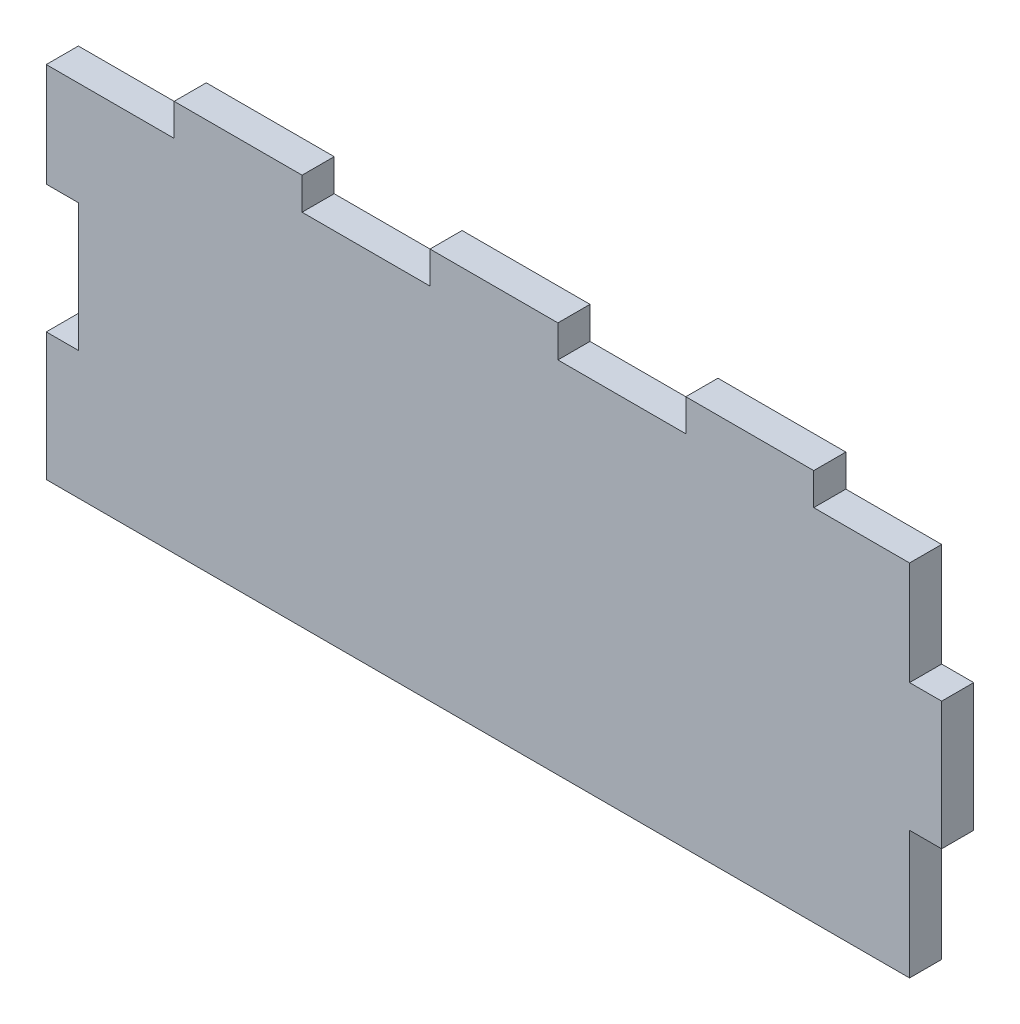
ISO-10303-21;
HEADER;
FILE_DESCRIPTION(('STEP AP214'),'2;1');
FILE_NAME('part.step','',(''),(''),'','','');
FILE_SCHEMA(('AUTOMOTIVE_DESIGN { 1 0 10303 214 1 1 1 1 }'));
ENDSEC;
DATA;
#1=APPLICATION_CONTEXT('core data for automotive mechanical design processes');
#2=APPLICATION_PROTOCOL_DEFINITION('international standard','automotive_design',2000,#1);
#3=PRODUCT_CONTEXT('',#1,'mechanical');
#4=PRODUCT('Part','Part','',(#3));
#5=PRODUCT_RELATED_PRODUCT_CATEGORY('part','',(#4));
#6=PRODUCT_DEFINITION_FORMATION('','',#4);
#7=PRODUCT_DEFINITION_CONTEXT('part definition',#1,'design');
#8=PRODUCT_DEFINITION('design','',#6,#7);
#9=PRODUCT_DEFINITION_SHAPE('','',#8);
#10=(LENGTH_UNIT() NAMED_UNIT(*) SI_UNIT(.MILLI.,.METRE.));
#11=(NAMED_UNIT(*) PLANE_ANGLE_UNIT() SI_UNIT($,.RADIAN.));
#12=(NAMED_UNIT(*) SI_UNIT($,.STERADIAN.) SOLID_ANGLE_UNIT());
#13=UNCERTAINTY_MEASURE_WITH_UNIT(LENGTH_MEASURE(1.E-05),#10,'distance_accuracy_value','');
#14=(GEOMETRIC_REPRESENTATION_CONTEXT(3) GLOBAL_UNCERTAINTY_ASSIGNED_CONTEXT((#13)) GLOBAL_UNIT_ASSIGNED_CONTEXT((#10,
#11,#12)) REPRESENTATION_CONTEXT('',''));
#15=CARTESIAN_POINT('',(0.,0.,0.));
#16=DIRECTION('',(0.,0.,1.));
#17=DIRECTION('',(1.,0.,0.));
#18=AXIS2_PLACEMENT_3D('',#15,#16,#17);
#19=CARTESIAN_POINT('',(417.168909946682,643.181563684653,19.));
#20=DIRECTION('',(0.,-1.,0.));
#21=DIRECTION('',(0.,0.,-1.));
#22=AXIS2_PLACEMENT_3D('',#19,#20,#21);
#23=PLANE('',#22);
#24=DIRECTION('',(-1.,0.,0.));
#25=VECTOR('',#24,1.);
#26=CARTESIAN_POINT('',(417.168909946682,643.181563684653,0.));
#27=LINE('',#26,#25);
#28=CARTESIAN_POINT('',(492.883195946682,643.181563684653,0.));
#29=VERTEX_POINT('',#28);
#30=CARTESIAN_POINT('',(417.168909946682,643.181563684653,0.));
#31=VERTEX_POINT('',#30);
#32=EDGE_CURVE('E225',#29,#31,#27,.T.);
#33=ORIENTED_EDGE('',*,*,#32,.T.);
#34=DIRECTION('',(0.,0.,-1.));
#35=VECTOR('',#34,1.);
#36=CARTESIAN_POINT('',(417.168909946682,643.181563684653,19.));
#37=LINE('',#36,#35);
#38=CARTESIAN_POINT('',(417.168909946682,643.181563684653,19.));
#39=VERTEX_POINT('',#38);
#40=EDGE_CURVE('E11',#39,#31,#37,.T.);
#41=ORIENTED_EDGE('',*,*,#40,.F.);
#42=DIRECTION('',(-1.,0.,0.));
#43=VECTOR('',#42,1.);
#44=CARTESIAN_POINT('',(417.168909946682,643.181563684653,19.));
#45=LINE('',#44,#43);
#46=CARTESIAN_POINT('',(492.883195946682,643.181563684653,19.));
#47=VERTEX_POINT('',#46);
#48=EDGE_CURVE('E271',#47,#39,#45,.T.);
#49=ORIENTED_EDGE('',*,*,#48,.F.);
#50=DIRECTION('',(0.,0.,-1.));
#51=VECTOR('',#50,1.);
#52=CARTESIAN_POINT('',(492.883195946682,643.181563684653,19.));
#53=LINE('',#52,#51);
#54=EDGE_CURVE('E221',#47,#29,#53,.T.);
#55=ORIENTED_EDGE('',*,*,#54,.T.);
#56=EDGE_LOOP('',(#33,#41,#49,#55));
#57=FACE_BOUND('',#56,.T.);
#58=ADVANCED_FACE('F33',(#57),#23,.F.);
#59=CARTESIAN_POINT('',(417.168909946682,643.181563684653,19.));
#60=DIRECTION('',(1.,0.,0.));
#61=DIRECTION('',(0.,1.,0.));
#62=AXIS2_PLACEMENT_3D('',#59,#60,#61);
#63=PLANE('',#62);
#64=DIRECTION('',(0.,-1.,0.));
#65=VECTOR('',#64,1.);
#66=CARTESIAN_POINT('',(417.168909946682,643.181563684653,0.));
#67=LINE('',#66,#65);
#68=CARTESIAN_POINT('',(417.168909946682,624.181563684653,0.));
#69=VERTEX_POINT('',#68);
#70=EDGE_CURVE('E228',#31,#69,#67,.T.);
#71=ORIENTED_EDGE('',*,*,#70,.T.);
#72=DIRECTION('',(0.,0.,-1.));
#73=VECTOR('',#72,1.);
#74=CARTESIAN_POINT('',(417.168909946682,624.181563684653,19.));
#75=LINE('',#74,#73);
#76=CARTESIAN_POINT('',(417.168909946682,624.181563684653,19.));
#77=VERTEX_POINT('',#76);
#78=EDGE_CURVE('E41',#77,#69,#75,.T.);
#79=ORIENTED_EDGE('',*,*,#78,.F.);
#80=DIRECTION('',(0.,-1.,0.));
#81=VECTOR('',#80,1.);
#82=CARTESIAN_POINT('',(417.168909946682,643.181563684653,19.));
#83=LINE('',#82,#81);
#84=EDGE_CURVE('E140',#39,#77,#83,.T.);
#85=ORIENTED_EDGE('',*,*,#84,.F.);
#86=ORIENTED_EDGE('',*,*,#40,.T.);
#87=EDGE_LOOP('',(#71,#79,#85,#86));
#88=FACE_BOUND('',#87,.T.);
#89=ADVANCED_FACE('F409',(#88),#63,.F.);
#90=CARTESIAN_POINT('',(341.454623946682,624.181563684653,19.));
#91=DIRECTION('',(0.,-1.,0.));
#92=DIRECTION('',(0.,0.,-1.));
#93=AXIS2_PLACEMENT_3D('',#90,#91,#92);
#94=PLANE('',#93);
#95=DIRECTION('',(-1.,0.,0.));
#96=VECTOR('',#95,1.);
#97=CARTESIAN_POINT('',(341.454623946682,624.181563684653,0.));
#98=LINE('',#97,#96);
#99=CARTESIAN_POINT('',(341.454623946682,624.181563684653,0.));
#100=VERTEX_POINT('',#99);
#101=EDGE_CURVE('E230',#69,#100,#98,.T.);
#102=ORIENTED_EDGE('',*,*,#101,.T.);
#103=DIRECTION('',(0.,0.,-1.));
#104=VECTOR('',#103,1.);
#105=CARTESIAN_POINT('',(341.454623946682,624.181563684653,19.));
#106=LINE('',#105,#104);
#107=CARTESIAN_POINT('',(341.454623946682,624.181563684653,19.));
#108=VERTEX_POINT('',#107);
#109=EDGE_CURVE('E326',#108,#100,#106,.T.);
#110=ORIENTED_EDGE('',*,*,#109,.F.);
#111=DIRECTION('',(-1.,0.,0.));
#112=VECTOR('',#111,1.);
#113=CARTESIAN_POINT('',(341.454623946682,624.181563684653,19.));
#114=LINE('',#113,#112);
#115=EDGE_CURVE('E334',#77,#108,#114,.T.);
#116=ORIENTED_EDGE('',*,*,#115,.F.);
#117=ORIENTED_EDGE('',*,*,#78,.T.);
#118=EDGE_LOOP('',(#102,#110,#116,#117));
#119=FACE_BOUND('',#118,.T.);
#120=ADVANCED_FACE('F332',(#119),#94,.F.);
#121=CARTESIAN_POINT('',(341.454623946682,562.852992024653,19.));
#122=DIRECTION('',(1.,0.,0.));
#123=DIRECTION('',(0.,0.,-1.));
#124=AXIS2_PLACEMENT_3D('',#121,#122,#123);
#125=PLANE('',#124);
#126=DIRECTION('',(0.,-1.,0.));
#127=VECTOR('',#126,1.);
#128=CARTESIAN_POINT('',(341.454623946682,562.852992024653,0.));
#129=LINE('',#128,#127);
#130=CARTESIAN_POINT('',(341.454623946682,562.852992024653,0.));
#131=VERTEX_POINT('',#130);
#132=EDGE_CURVE('E232',#100,#131,#129,.T.);
#133=ORIENTED_EDGE('',*,*,#132,.T.);
#134=DIRECTION('',(0.,0.,-1.));
#135=VECTOR('',#134,1.);
#136=CARTESIAN_POINT('',(341.454623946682,562.852992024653,19.));
#137=LINE('',#136,#135);
#138=CARTESIAN_POINT('',(341.454623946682,562.852992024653,19.));
#139=VERTEX_POINT('',#138);
#140=EDGE_CURVE('E323',#139,#131,#137,.T.);
#141=ORIENTED_EDGE('',*,*,#140,.F.);
#142=DIRECTION('',(0.,-1.,0.));
#143=VECTOR('',#142,1.);
#144=CARTESIAN_POINT('',(341.454623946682,562.852992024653,19.));
#145=LINE('',#144,#143);
#146=EDGE_CURVE('E352',#108,#139,#145,.T.);
#147=ORIENTED_EDGE('',*,*,#146,.F.);
#148=ORIENTED_EDGE('',*,*,#109,.T.);
#149=EDGE_LOOP('',(#133,#141,#147,#148));
#150=FACE_BOUND('',#149,.T.);
#151=ADVANCED_FACE('F343',(#150),#125,.F.);
#152=CARTESIAN_POINT('',(341.454623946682,562.852992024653,19.));
#153=DIRECTION('',(0.,1.,0.));
#154=DIRECTION('',(0.,0.,1.));
#155=AXIS2_PLACEMENT_3D('',#152,#153,#154);
#156=PLANE('',#155);
#157=DIRECTION('',(1.,0.,0.));
#158=VECTOR('',#157,1.);
#159=CARTESIAN_POINT('',(341.454623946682,562.852992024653,0.));
#160=LINE('',#159,#158);
#161=CARTESIAN_POINT('',(360.454623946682,562.852992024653,0.));
#162=VERTEX_POINT('',#161);
#163=EDGE_CURVE('E234',#131,#162,#160,.T.);
#164=ORIENTED_EDGE('',*,*,#163,.T.);
#165=DIRECTION('',(0.,0.,-1.));
#166=VECTOR('',#165,1.);
#167=CARTESIAN_POINT('',(360.454623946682,562.852992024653,19.));
#168=LINE('',#167,#166);
#169=CARTESIAN_POINT('',(360.454623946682,562.852992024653,19.));
#170=VERTEX_POINT('',#169);
#171=EDGE_CURVE('E320',#170,#162,#168,.T.);
#172=ORIENTED_EDGE('',*,*,#171,.F.);
#173=DIRECTION('',(1.,0.,0.));
#174=VECTOR('',#173,1.);
#175=CARTESIAN_POINT('',(341.454623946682,562.852992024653,19.));
#176=LINE('',#175,#174);
#177=EDGE_CURVE('E349',#139,#170,#176,.T.);
#178=ORIENTED_EDGE('',*,*,#177,.F.);
#179=ORIENTED_EDGE('',*,*,#140,.T.);
#180=EDGE_LOOP('',(#164,#172,#178,#179));
#181=FACE_BOUND('',#180,.T.);
#182=ADVANCED_FACE('F347',(#181),#156,.F.);
#183=CARTESIAN_POINT('',(360.454623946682,562.852992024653,19.));
#184=DIRECTION('',(1.,0.,0.));
#185=DIRECTION('',(0.,0.,-1.));
#186=AXIS2_PLACEMENT_3D('',#183,#184,#185);
#187=PLANE('',#186);
#188=DIRECTION('',(0.,-1.,0.));
#189=VECTOR('',#188,1.);
#190=CARTESIAN_POINT('',(360.454623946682,562.852992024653,0.));
#191=LINE('',#190,#189);
#192=CARTESIAN_POINT('',(360.454623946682,487.138706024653,0.));
#193=VERTEX_POINT('',#192);
#194=EDGE_CURVE('E236',#162,#193,#191,.T.);
#195=ORIENTED_EDGE('',*,*,#194,.T.);
#196=DIRECTION('',(0.,0.,-1.));
#197=VECTOR('',#196,1.);
#198=CARTESIAN_POINT('',(360.454623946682,487.138706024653,19.));
#199=LINE('',#198,#197);
#200=CARTESIAN_POINT('',(360.454623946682,487.138706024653,19.));
#201=VERTEX_POINT('',#200);
#202=EDGE_CURVE('E317',#201,#193,#199,.T.);
#203=ORIENTED_EDGE('',*,*,#202,.F.);
#204=DIRECTION('',(0.,-1.,0.));
#205=VECTOR('',#204,1.);
#206=CARTESIAN_POINT('',(360.454623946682,562.852992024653,19.));
#207=LINE('',#206,#205);
#208=EDGE_CURVE('E351',#170,#201,#207,.T.);
#209=ORIENTED_EDGE('',*,*,#208,.F.);
#210=ORIENTED_EDGE('',*,*,#171,.T.);
#211=EDGE_LOOP('',(#195,#203,#209,#210));
#212=FACE_BOUND('',#211,.T.);
#213=ADVANCED_FACE('F422',(#212),#187,.F.);
#214=CARTESIAN_POINT('',(341.454623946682,487.138706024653,19.));
#215=DIRECTION('',(0.,-1.,0.));
#216=DIRECTION('',(0.,0.,-1.));
#217=AXIS2_PLACEMENT_3D('',#214,#215,#216);
#218=PLANE('',#217);
#219=DIRECTION('',(-1.,0.,0.));
#220=VECTOR('',#219,1.);
#221=CARTESIAN_POINT('',(341.454623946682,487.138706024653,0.));
#222=LINE('',#221,#220);
#223=CARTESIAN_POINT('',(341.454623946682,487.138706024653,0.));
#224=VERTEX_POINT('',#223);
#225=EDGE_CURVE('E238',#193,#224,#222,.T.);
#226=ORIENTED_EDGE('',*,*,#225,.T.);
#227=DIRECTION('',(0.,0.,-1.));
#228=VECTOR('',#227,1.);
#229=CARTESIAN_POINT('',(341.454623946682,487.138706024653,19.));
#230=LINE('',#229,#228);
#231=CARTESIAN_POINT('',(341.454623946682,487.138706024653,19.));
#232=VERTEX_POINT('',#231);
#233=EDGE_CURVE('E314',#232,#224,#230,.T.);
#234=ORIENTED_EDGE('',*,*,#233,.F.);
#235=DIRECTION('',(-1.,0.,0.));
#236=VECTOR('',#235,1.);
#237=CARTESIAN_POINT('',(341.454623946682,487.138706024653,19.));
#238=LINE('',#237,#236);
#239=EDGE_CURVE('E354',#201,#232,#238,.T.);
#240=ORIENTED_EDGE('',*,*,#239,.F.);
#241=ORIENTED_EDGE('',*,*,#202,.T.);
#242=EDGE_LOOP('',(#226,#234,#240,#241));
#243=FACE_BOUND('',#242,.T.);
#244=ADVANCED_FACE('F425',(#243),#218,.F.);
#245=CARTESIAN_POINT('',(341.454623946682,487.138706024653,19.));
#246=DIRECTION('',(1.,0.,0.));
#247=DIRECTION('',(0.,0.,-1.));
#248=AXIS2_PLACEMENT_3D('',#245,#246,#247);
#249=PLANE('',#248);
#250=DIRECTION('',(0.,-1.,0.));
#251=VECTOR('',#250,1.);
#252=CARTESIAN_POINT('',(341.454623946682,487.138706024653,0.));
#253=LINE('',#252,#251);
#254=CARTESIAN_POINT('',(341.454623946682,411.424420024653,0.));
#255=VERTEX_POINT('',#254);
#256=EDGE_CURVE('E240',#224,#255,#253,.T.);
#257=ORIENTED_EDGE('',*,*,#256,.T.);
#258=DIRECTION('',(0.,0.,-1.));
#259=VECTOR('',#258,1.);
#260=CARTESIAN_POINT('',(341.454623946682,411.424420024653,19.));
#261=LINE('',#260,#259);
#262=CARTESIAN_POINT('',(341.454623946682,411.424420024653,19.));
#263=VERTEX_POINT('',#262);
#264=EDGE_CURVE('E311',#263,#255,#261,.T.);
#265=ORIENTED_EDGE('',*,*,#264,.F.);
#266=DIRECTION('',(0.,-1.,0.));
#267=VECTOR('',#266,1.);
#268=CARTESIAN_POINT('',(341.454623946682,487.138706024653,19.));
#269=LINE('',#268,#267);
#270=EDGE_CURVE('E360',#232,#263,#269,.T.);
#271=ORIENTED_EDGE('',*,*,#270,.F.);
#272=ORIENTED_EDGE('',*,*,#233,.T.);
#273=EDGE_LOOP('',(#257,#265,#271,#272));
#274=FACE_BOUND('',#273,.T.);
#275=ADVANCED_FACE('F429',(#274),#249,.F.);
#276=CARTESIAN_POINT('',(341.454623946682,411.424420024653,19.));
#277=DIRECTION('',(0.,1.,0.));
#278=DIRECTION('',(-1.,0.,0.));
#279=AXIS2_PLACEMENT_3D('',#276,#277,#278);
#280=PLANE('',#279);
#281=DIRECTION('',(1.,0.,0.));
#282=VECTOR('',#281,1.);
#283=CARTESIAN_POINT('',(341.454623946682,411.424420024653,0.));
#284=LINE('',#283,#282);
#285=CARTESIAN_POINT('',(852.454623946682,411.424420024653,0.));
#286=VERTEX_POINT('',#285);
#287=EDGE_CURVE('E242',#255,#286,#284,.T.);
#288=ORIENTED_EDGE('',*,*,#287,.T.);
#289=DIRECTION('',(0.,0.,-1.));
#290=VECTOR('',#289,1.);
#291=CARTESIAN_POINT('',(852.454623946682,411.424420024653,19.));
#292=LINE('',#291,#290);
#293=CARTESIAN_POINT('',(852.454623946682,411.424420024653,19.));
#294=VERTEX_POINT('',#293);
#295=EDGE_CURVE('E308',#294,#286,#292,.T.);
#296=ORIENTED_EDGE('',*,*,#295,.F.);
#297=DIRECTION('',(1.,0.,0.));
#298=VECTOR('',#297,1.);
#299=CARTESIAN_POINT('',(341.454623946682,411.424420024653,19.));
#300=LINE('',#299,#298);
#301=EDGE_CURVE('E362',#263,#294,#300,.T.);
#302=ORIENTED_EDGE('',*,*,#301,.F.);
#303=ORIENTED_EDGE('',*,*,#264,.T.);
#304=EDGE_LOOP('',(#288,#296,#302,#303));
#305=FACE_BOUND('',#304,.T.);
#306=ADVANCED_FACE('F433',(#305),#280,.F.);
#307=CARTESIAN_POINT('',(852.454623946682,487.138706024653,19.));
#308=DIRECTION('',(-1.,0.,0.));
#309=DIRECTION('',(0.,0.,1.));
#310=AXIS2_PLACEMENT_3D('',#307,#308,#309);
#311=PLANE('',#310);
#312=DIRECTION('',(0.,1.,0.));
#313=VECTOR('',#312,1.);
#314=CARTESIAN_POINT('',(852.454623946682,487.138706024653,0.));
#315=LINE('',#314,#313);
#316=CARTESIAN_POINT('',(852.454623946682,487.138706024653,0.));
#317=VERTEX_POINT('',#316);
#318=EDGE_CURVE('E244',#286,#317,#315,.T.);
#319=ORIENTED_EDGE('',*,*,#318,.T.);
#320=DIRECTION('',(0.,0.,-1.));
#321=VECTOR('',#320,1.);
#322=CARTESIAN_POINT('',(852.454623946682,487.138706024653,19.));
#323=LINE('',#322,#321);
#324=CARTESIAN_POINT('',(852.454623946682,487.138706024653,19.));
#325=VERTEX_POINT('',#324);
#326=EDGE_CURVE('E305',#325,#317,#323,.T.);
#327=ORIENTED_EDGE('',*,*,#326,.F.);
#328=DIRECTION('',(0.,1.,0.));
#329=VECTOR('',#328,1.);
#330=CARTESIAN_POINT('',(852.454623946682,487.138706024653,19.));
#331=LINE('',#330,#329);
#332=EDGE_CURVE('E364',#294,#325,#331,.T.);
#333=ORIENTED_EDGE('',*,*,#332,.F.);
#334=ORIENTED_EDGE('',*,*,#295,.T.);
#335=EDGE_LOOP('',(#319,#327,#333,#334));
#336=FACE_BOUND('',#335,.T.);
#337=ADVANCED_FACE('F437',(#336),#311,.F.);
#338=CARTESIAN_POINT('',(852.454623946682,487.138706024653,19.));
#339=DIRECTION('',(0.,1.,0.));
#340=DIRECTION('',(0.,0.,1.));
#341=AXIS2_PLACEMENT_3D('',#338,#339,#340);
#342=PLANE('',#341);
#343=DIRECTION('',(1.,0.,0.));
#344=VECTOR('',#343,1.);
#345=CARTESIAN_POINT('',(852.454623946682,487.138706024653,0.));
#346=LINE('',#345,#344);
#347=CARTESIAN_POINT('',(871.454623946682,487.138706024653,0.));
#348=VERTEX_POINT('',#347);
#349=EDGE_CURVE('E246',#317,#348,#346,.T.);
#350=ORIENTED_EDGE('',*,*,#349,.T.);
#351=DIRECTION('',(0.,0.,-1.));
#352=VECTOR('',#351,1.);
#353=CARTESIAN_POINT('',(871.454623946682,487.138706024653,19.));
#354=LINE('',#353,#352);
#355=CARTESIAN_POINT('',(871.454623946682,487.138706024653,19.));
#356=VERTEX_POINT('',#355);
#357=EDGE_CURVE('E302',#356,#348,#354,.T.);
#358=ORIENTED_EDGE('',*,*,#357,.F.);
#359=DIRECTION('',(1.,0.,0.));
#360=VECTOR('',#359,1.);
#361=CARTESIAN_POINT('',(852.454623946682,487.138706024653,19.));
#362=LINE('',#361,#360);
#363=EDGE_CURVE('E366',#325,#356,#362,.T.);
#364=ORIENTED_EDGE('',*,*,#363,.F.);
#365=ORIENTED_EDGE('',*,*,#326,.T.);
#366=EDGE_LOOP('',(#350,#358,#364,#365));
#367=FACE_BOUND('',#366,.T.);
#368=ADVANCED_FACE('F441',(#367),#342,.F.);
#369=CARTESIAN_POINT('',(871.454623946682,562.852992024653,19.));
#370=DIRECTION('',(-1.,0.,0.));
#371=DIRECTION('',(0.,0.,1.));
#372=AXIS2_PLACEMENT_3D('',#369,#370,#371);
#373=PLANE('',#372);
#374=DIRECTION('',(0.,1.,0.));
#375=VECTOR('',#374,1.);
#376=CARTESIAN_POINT('',(871.454623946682,562.852992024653,0.));
#377=LINE('',#376,#375);
#378=CARTESIAN_POINT('',(871.454623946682,562.852992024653,0.));
#379=VERTEX_POINT('',#378);
#380=EDGE_CURVE('E248',#348,#379,#377,.T.);
#381=ORIENTED_EDGE('',*,*,#380,.T.);
#382=DIRECTION('',(0.,0.,-1.));
#383=VECTOR('',#382,1.);
#384=CARTESIAN_POINT('',(871.454623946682,562.852992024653,19.));
#385=LINE('',#384,#383);
#386=CARTESIAN_POINT('',(871.454623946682,562.852992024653,19.));
#387=VERTEX_POINT('',#386);
#388=EDGE_CURVE('E299',#387,#379,#385,.T.);
#389=ORIENTED_EDGE('',*,*,#388,.F.);
#390=DIRECTION('',(0.,1.,0.));
#391=VECTOR('',#390,1.);
#392=CARTESIAN_POINT('',(871.454623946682,562.852992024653,19.));
#393=LINE('',#392,#391);
#394=EDGE_CURVE('E368',#356,#387,#393,.T.);
#395=ORIENTED_EDGE('',*,*,#394,.F.);
#396=ORIENTED_EDGE('',*,*,#357,.T.);
#397=EDGE_LOOP('',(#381,#389,#395,#396));
#398=FACE_BOUND('',#397,.T.);
#399=ADVANCED_FACE('F445',(#398),#373,.F.);
#400=CARTESIAN_POINT('',(852.454623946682,562.852992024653,19.));
#401=DIRECTION('',(0.,-1.,0.));
#402=DIRECTION('',(0.,0.,-1.));
#403=AXIS2_PLACEMENT_3D('',#400,#401,#402);
#404=PLANE('',#403);
#405=DIRECTION('',(-1.,0.,0.));
#406=VECTOR('',#405,1.);
#407=CARTESIAN_POINT('',(852.454623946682,562.852992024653,0.));
#408=LINE('',#407,#406);
#409=CARTESIAN_POINT('',(852.454623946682,562.852992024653,0.));
#410=VERTEX_POINT('',#409);
#411=EDGE_CURVE('E250',#379,#410,#408,.T.);
#412=ORIENTED_EDGE('',*,*,#411,.T.);
#413=DIRECTION('',(0.,0.,-1.));
#414=VECTOR('',#413,1.);
#415=CARTESIAN_POINT('',(852.454623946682,562.852992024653,19.));
#416=LINE('',#415,#414);
#417=CARTESIAN_POINT('',(852.454623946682,562.852992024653,19.));
#418=VERTEX_POINT('',#417);
#419=EDGE_CURVE('E296',#418,#410,#416,.T.);
#420=ORIENTED_EDGE('',*,*,#419,.F.);
#421=DIRECTION('',(-1.,0.,0.));
#422=VECTOR('',#421,1.);
#423=CARTESIAN_POINT('',(852.454623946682,562.852992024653,19.));
#424=LINE('',#423,#422);
#425=EDGE_CURVE('E370',#387,#418,#424,.T.);
#426=ORIENTED_EDGE('',*,*,#425,.F.);
#427=ORIENTED_EDGE('',*,*,#388,.T.);
#428=EDGE_LOOP('',(#412,#420,#426,#427));
#429=FACE_BOUND('',#428,.T.);
#430=ADVANCED_FACE('F449',(#429),#404,.F.);
#431=CARTESIAN_POINT('',(852.454623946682,624.181563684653,19.));
#432=DIRECTION('',(-1.,0.,0.));
#433=DIRECTION('',(0.,0.,1.));
#434=AXIS2_PLACEMENT_3D('',#431,#432,#433);
#435=PLANE('',#434);
#436=DIRECTION('',(0.,1.,0.));
#437=VECTOR('',#436,1.);
#438=CARTESIAN_POINT('',(852.454623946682,624.181563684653,0.));
#439=LINE('',#438,#437);
#440=CARTESIAN_POINT('',(852.454623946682,624.181563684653,0.));
#441=VERTEX_POINT('',#440);
#442=EDGE_CURVE('E252',#410,#441,#439,.T.);
#443=ORIENTED_EDGE('',*,*,#442,.T.);
#444=DIRECTION('',(0.,0.,-1.));
#445=VECTOR('',#444,1.);
#446=CARTESIAN_POINT('',(852.454623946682,624.181563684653,19.));
#447=LINE('',#446,#445);
#448=CARTESIAN_POINT('',(852.454623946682,624.181563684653,19.));
#449=VERTEX_POINT('',#448);
#450=EDGE_CURVE('E293',#449,#441,#447,.T.);
#451=ORIENTED_EDGE('',*,*,#450,.F.);
#452=DIRECTION('',(0.,1.,0.));
#453=VECTOR('',#452,1.);
#454=CARTESIAN_POINT('',(852.454623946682,624.181563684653,19.));
#455=LINE('',#454,#453);
#456=EDGE_CURVE('E372',#418,#449,#455,.T.);
#457=ORIENTED_EDGE('',*,*,#456,.F.);
#458=ORIENTED_EDGE('',*,*,#419,.T.);
#459=EDGE_LOOP('',(#443,#451,#457,#458));
#460=FACE_BOUND('',#459,.T.);
#461=ADVANCED_FACE('F453',(#460),#435,.F.);
#462=CARTESIAN_POINT('',(795.740339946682,624.181563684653,19.));
#463=DIRECTION('',(0.,-1.,0.));
#464=DIRECTION('',(0.,0.,-1.));
#465=AXIS2_PLACEMENT_3D('',#462,#463,#464);
#466=PLANE('',#465);
#467=DIRECTION('',(-1.,0.,0.));
#468=VECTOR('',#467,1.);
#469=CARTESIAN_POINT('',(795.740339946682,624.181563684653,0.));
#470=LINE('',#469,#468);
#471=CARTESIAN_POINT('',(795.740339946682,624.181563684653,0.));
#472=VERTEX_POINT('',#471);
#473=EDGE_CURVE('E254',#441,#472,#470,.T.);
#474=ORIENTED_EDGE('',*,*,#473,.T.);
#475=DIRECTION('',(0.,0.,-1.));
#476=VECTOR('',#475,1.);
#477=CARTESIAN_POINT('',(795.740339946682,624.181563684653,19.));
#478=LINE('',#477,#476);
#479=CARTESIAN_POINT('',(795.740339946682,624.181563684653,19.));
#480=VERTEX_POINT('',#479);
#481=EDGE_CURVE('E290',#480,#472,#478,.T.);
#482=ORIENTED_EDGE('',*,*,#481,.F.);
#483=DIRECTION('',(-1.,0.,0.));
#484=VECTOR('',#483,1.);
#485=CARTESIAN_POINT('',(795.740339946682,624.181563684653,19.));
#486=LINE('',#485,#484);
#487=EDGE_CURVE('E374',#449,#480,#486,.T.);
#488=ORIENTED_EDGE('',*,*,#487,.F.);
#489=ORIENTED_EDGE('',*,*,#450,.T.);
#490=EDGE_LOOP('',(#474,#482,#488,#489));
#491=FACE_BOUND('',#490,.T.);
#492=ADVANCED_FACE('F457',(#491),#466,.F.);
#493=CARTESIAN_POINT('',(795.740339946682,643.181563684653,19.));
#494=DIRECTION('',(-1.,0.,0.));
#495=DIRECTION('',(0.,0.,1.));
#496=AXIS2_PLACEMENT_3D('',#493,#494,#495);
#497=PLANE('',#496);
#498=DIRECTION('',(0.,1.,0.));
#499=VECTOR('',#498,1.);
#500=CARTESIAN_POINT('',(795.740339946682,643.181563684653,0.));
#501=LINE('',#500,#499);
#502=CARTESIAN_POINT('',(795.740339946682,643.181563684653,0.));
#503=VERTEX_POINT('',#502);
#504=EDGE_CURVE('E256',#472,#503,#501,.T.);
#505=ORIENTED_EDGE('',*,*,#504,.T.);
#506=DIRECTION('',(0.,0.,-1.));
#507=VECTOR('',#506,1.);
#508=CARTESIAN_POINT('',(795.740339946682,643.181563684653,19.));
#509=LINE('',#508,#507);
#510=CARTESIAN_POINT('',(795.740339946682,643.181563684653,19.));
#511=VERTEX_POINT('',#510);
#512=EDGE_CURVE('E287',#511,#503,#509,.T.);
#513=ORIENTED_EDGE('',*,*,#512,.F.);
#514=DIRECTION('',(0.,1.,0.));
#515=VECTOR('',#514,1.);
#516=CARTESIAN_POINT('',(795.740339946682,643.181563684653,19.));
#517=LINE('',#516,#515);
#518=EDGE_CURVE('E376',#480,#511,#517,.T.);
#519=ORIENTED_EDGE('',*,*,#518,.F.);
#520=ORIENTED_EDGE('',*,*,#481,.T.);
#521=EDGE_LOOP('',(#505,#513,#519,#520));
#522=FACE_BOUND('',#521,.T.);
#523=ADVANCED_FACE('F461',(#522),#497,.F.);
#524=CARTESIAN_POINT('',(720.026053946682,643.181563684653,19.));
#525=DIRECTION('',(0.,-1.,0.));
#526=DIRECTION('',(0.,0.,-1.));
#527=AXIS2_PLACEMENT_3D('',#524,#525,#526);
#528=PLANE('',#527);
#529=DIRECTION('',(-1.,0.,0.));
#530=VECTOR('',#529,1.);
#531=CARTESIAN_POINT('',(720.026053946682,643.181563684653,0.));
#532=LINE('',#531,#530);
#533=CARTESIAN_POINT('',(720.026053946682,643.181563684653,0.));
#534=VERTEX_POINT('',#533);
#535=EDGE_CURVE('E258',#503,#534,#532,.T.);
#536=ORIENTED_EDGE('',*,*,#535,.T.);
#537=DIRECTION('',(0.,0.,-1.));
#538=VECTOR('',#537,1.);
#539=CARTESIAN_POINT('',(720.026053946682,643.181563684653,19.));
#540=LINE('',#539,#538);
#541=CARTESIAN_POINT('',(720.026053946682,643.181563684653,19.));
#542=VERTEX_POINT('',#541);
#543=EDGE_CURVE('E284',#542,#534,#540,.T.);
#544=ORIENTED_EDGE('',*,*,#543,.F.);
#545=DIRECTION('',(-1.,0.,0.));
#546=VECTOR('',#545,1.);
#547=CARTESIAN_POINT('',(720.026053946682,643.181563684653,19.));
#548=LINE('',#547,#546);
#549=EDGE_CURVE('E378',#511,#542,#548,.T.);
#550=ORIENTED_EDGE('',*,*,#549,.F.);
#551=ORIENTED_EDGE('',*,*,#512,.T.);
#552=EDGE_LOOP('',(#536,#544,#550,#551));
#553=FACE_BOUND('',#552,.T.);
#554=ADVANCED_FACE('F465',(#553),#528,.F.);
#555=CARTESIAN_POINT('',(720.026053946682,643.181563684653,19.));
#556=DIRECTION('',(1.,0.,0.));
#557=DIRECTION('',(0.,0.,-1.));
#558=AXIS2_PLACEMENT_3D('',#555,#556,#557);
#559=PLANE('',#558);
#560=DIRECTION('',(0.,-1.,0.));
#561=VECTOR('',#560,1.);
#562=CARTESIAN_POINT('',(720.026053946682,643.181563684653,0.));
#563=LINE('',#562,#561);
#564=CARTESIAN_POINT('',(720.026053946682,624.181563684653,0.));
#565=VERTEX_POINT('',#564);
#566=EDGE_CURVE('E260',#534,#565,#563,.T.);
#567=ORIENTED_EDGE('',*,*,#566,.T.);
#568=DIRECTION('',(0.,0.,-1.));
#569=VECTOR('',#568,1.);
#570=CARTESIAN_POINT('',(720.026053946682,624.181563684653,19.));
#571=LINE('',#570,#569);
#572=CARTESIAN_POINT('',(720.026053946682,624.181563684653,19.));
#573=VERTEX_POINT('',#572);
#574=EDGE_CURVE('E281',#573,#565,#571,.T.);
#575=ORIENTED_EDGE('',*,*,#574,.F.);
#576=DIRECTION('',(0.,-1.,0.));
#577=VECTOR('',#576,1.);
#578=CARTESIAN_POINT('',(720.026053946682,643.181563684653,19.));
#579=LINE('',#578,#577);
#580=EDGE_CURVE('E380',#542,#573,#579,.T.);
#581=ORIENTED_EDGE('',*,*,#580,.F.);
#582=ORIENTED_EDGE('',*,*,#543,.T.);
#583=EDGE_LOOP('',(#567,#575,#581,#582));
#584=FACE_BOUND('',#583,.T.);
#585=ADVANCED_FACE('F469',(#584),#559,.F.);
#586=CARTESIAN_POINT('',(644.311767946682,624.181563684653,19.));
#587=DIRECTION('',(0.,-1.,0.));
#588=DIRECTION('',(0.,0.,-1.));
#589=AXIS2_PLACEMENT_3D('',#586,#587,#588);
#590=PLANE('',#589);
#591=DIRECTION('',(-1.,0.,0.));
#592=VECTOR('',#591,1.);
#593=CARTESIAN_POINT('',(644.311767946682,624.181563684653,0.));
#594=LINE('',#593,#592);
#595=CARTESIAN_POINT('',(644.311767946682,624.181563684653,0.));
#596=VERTEX_POINT('',#595);
#597=EDGE_CURVE('E262',#565,#596,#594,.T.);
#598=ORIENTED_EDGE('',*,*,#597,.T.);
#599=DIRECTION('',(0.,0.,-1.));
#600=VECTOR('',#599,1.);
#601=CARTESIAN_POINT('',(644.311767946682,624.181563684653,19.));
#602=LINE('',#601,#600);
#603=CARTESIAN_POINT('',(644.311767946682,624.181563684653,19.));
#604=VERTEX_POINT('',#603);
#605=EDGE_CURVE('E278',#604,#596,#602,.T.);
#606=ORIENTED_EDGE('',*,*,#605,.F.);
#607=DIRECTION('',(-1.,0.,0.));
#608=VECTOR('',#607,1.);
#609=CARTESIAN_POINT('',(644.311767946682,624.181563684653,19.));
#610=LINE('',#609,#608);
#611=EDGE_CURVE('E382',#573,#604,#610,.T.);
#612=ORIENTED_EDGE('',*,*,#611,.F.);
#613=ORIENTED_EDGE('',*,*,#574,.T.);
#614=EDGE_LOOP('',(#598,#606,#612,#613));
#615=FACE_BOUND('',#614,.T.);
#616=ADVANCED_FACE('F473',(#615),#590,.F.);
#617=CARTESIAN_POINT('',(644.311767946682,643.181563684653,19.));
#618=DIRECTION('',(-1.,0.,0.));
#619=DIRECTION('',(0.,0.,1.));
#620=AXIS2_PLACEMENT_3D('',#617,#618,#619);
#621=PLANE('',#620);
#622=DIRECTION('',(0.,1.,0.));
#623=VECTOR('',#622,1.);
#624=CARTESIAN_POINT('',(644.311767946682,643.181563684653,0.));
#625=LINE('',#624,#623);
#626=CARTESIAN_POINT('',(644.311767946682,643.181563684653,0.));
#627=VERTEX_POINT('',#626);
#628=EDGE_CURVE('E264',#596,#627,#625,.T.);
#629=ORIENTED_EDGE('',*,*,#628,.T.);
#630=DIRECTION('',(0.,0.,-1.));
#631=VECTOR('',#630,1.);
#632=CARTESIAN_POINT('',(644.311767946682,643.181563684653,19.));
#633=LINE('',#632,#631);
#634=CARTESIAN_POINT('',(644.311767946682,643.181563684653,19.));
#635=VERTEX_POINT('',#634);
#636=EDGE_CURVE('E275',#635,#627,#633,.T.);
#637=ORIENTED_EDGE('',*,*,#636,.F.);
#638=DIRECTION('',(0.,1.,0.));
#639=VECTOR('',#638,1.);
#640=CARTESIAN_POINT('',(644.311767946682,643.181563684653,19.));
#641=LINE('',#640,#639);
#642=EDGE_CURVE('E384',#604,#635,#641,.T.);
#643=ORIENTED_EDGE('',*,*,#642,.F.);
#644=ORIENTED_EDGE('',*,*,#605,.T.);
#645=EDGE_LOOP('',(#629,#637,#643,#644));
#646=FACE_BOUND('',#645,.T.);
#647=ADVANCED_FACE('F390',(#646),#621,.F.);
#648=CARTESIAN_POINT('',(568.597481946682,643.181563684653,19.));
#649=DIRECTION('',(0.,-1.,0.));
#650=DIRECTION('',(0.,0.,-1.));
#651=AXIS2_PLACEMENT_3D('',#648,#649,#650);
#652=PLANE('',#651);
#653=DIRECTION('',(-1.,0.,0.));
#654=VECTOR('',#653,1.);
#655=CARTESIAN_POINT('',(568.597481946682,643.181563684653,0.));
#656=LINE('',#655,#654);
#657=CARTESIAN_POINT('',(568.597481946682,643.181563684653,0.));
#658=VERTEX_POINT('',#657);
#659=EDGE_CURVE('E266',#627,#658,#656,.T.);
#660=ORIENTED_EDGE('',*,*,#659,.T.);
#661=DIRECTION('',(0.,0.,-1.));
#662=VECTOR('',#661,1.);
#663=CARTESIAN_POINT('',(568.597481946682,643.181563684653,19.));
#664=LINE('',#663,#662);
#665=CARTESIAN_POINT('',(568.597481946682,643.181563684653,19.));
#666=VERTEX_POINT('',#665);
#667=EDGE_CURVE('E216',#666,#658,#664,.T.);
#668=ORIENTED_EDGE('',*,*,#667,.F.);
#669=DIRECTION('',(-1.,0.,0.));
#670=VECTOR('',#669,1.);
#671=CARTESIAN_POINT('',(568.597481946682,643.181563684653,19.));
#672=LINE('',#671,#670);
#673=EDGE_CURVE('E207',#635,#666,#672,.T.);
#674=ORIENTED_EDGE('',*,*,#673,.F.);
#675=ORIENTED_EDGE('',*,*,#636,.T.);
#676=EDGE_LOOP('',(#660,#668,#674,#675));
#677=FACE_BOUND('',#676,.T.);
#678=ADVANCED_FACE('F394',(#677),#652,.F.);
#679=CARTESIAN_POINT('',(568.597481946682,643.181563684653,19.));
#680=DIRECTION('',(1.,0.,0.));
#681=DIRECTION('',(0.,1.,0.));
#682=AXIS2_PLACEMENT_3D('',#679,#680,#681);
#683=PLANE('',#682);
#684=DIRECTION('',(0.,-1.,0.));
#685=VECTOR('',#684,1.);
#686=CARTESIAN_POINT('',(568.597481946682,643.181563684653,0.));
#687=LINE('',#686,#685);
#688=CARTESIAN_POINT('',(568.597481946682,624.181563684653,0.));
#689=VERTEX_POINT('',#688);
#690=EDGE_CURVE('E215',#658,#689,#687,.T.);
#691=ORIENTED_EDGE('',*,*,#690,.T.);
#692=DIRECTION('',(0.,0.,-1.));
#693=VECTOR('',#692,1.);
#694=CARTESIAN_POINT('',(568.597481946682,624.181563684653,19.));
#695=LINE('',#694,#693);
#696=CARTESIAN_POINT('',(568.597481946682,624.181563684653,19.));
#697=VERTEX_POINT('',#696);
#698=EDGE_CURVE('E212',#697,#689,#695,.T.);
#699=ORIENTED_EDGE('',*,*,#698,.F.);
#700=DIRECTION('',(0.,-1.,0.));
#701=VECTOR('',#700,1.);
#702=CARTESIAN_POINT('',(568.597481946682,643.181563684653,19.));
#703=LINE('',#702,#701);
#704=EDGE_CURVE('E201',#666,#697,#703,.T.);
#705=ORIENTED_EDGE('',*,*,#704,.F.);
#706=ORIENTED_EDGE('',*,*,#667,.T.);
#707=EDGE_LOOP('',(#691,#699,#705,#706));
#708=FACE_BOUND('',#707,.T.);
#709=ADVANCED_FACE('F213',(#708),#683,.F.);
#710=CARTESIAN_POINT('',(492.883195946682,624.181563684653,19.));
#711=DIRECTION('',(0.,-1.,0.));
#712=DIRECTION('',(0.,0.,-1.));
#713=AXIS2_PLACEMENT_3D('',#710,#711,#712);
#714=PLANE('',#713);
#715=DIRECTION('',(-1.,0.,0.));
#716=VECTOR('',#715,1.);
#717=CARTESIAN_POINT('',(492.883195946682,624.181563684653,0.));
#718=LINE('',#717,#716);
#719=CARTESIAN_POINT('',(492.883195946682,624.181563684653,0.));
#720=VERTEX_POINT('',#719);
#721=EDGE_CURVE('E126',#689,#720,#718,.T.);
#722=ORIENTED_EDGE('',*,*,#721,.T.);
#723=DIRECTION('',(0.,0.,-1.));
#724=VECTOR('',#723,1.);
#725=CARTESIAN_POINT('',(492.883195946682,624.181563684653,19.));
#726=LINE('',#725,#724);
#727=CARTESIAN_POINT('',(492.883195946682,624.181563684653,19.));
#728=VERTEX_POINT('',#727);
#729=EDGE_CURVE('E217',#728,#720,#726,.T.);
#730=ORIENTED_EDGE('',*,*,#729,.F.);
#731=DIRECTION('',(-1.,0.,0.));
#732=VECTOR('',#731,1.);
#733=CARTESIAN_POINT('',(492.883195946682,624.181563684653,19.));
#734=LINE('',#733,#732);
#735=EDGE_CURVE('E205',#697,#728,#734,.T.);
#736=ORIENTED_EDGE('',*,*,#735,.F.);
#737=ORIENTED_EDGE('',*,*,#698,.T.);
#738=EDGE_LOOP('',(#722,#730,#736,#737));
#739=FACE_BOUND('',#738,.T.);
#740=ADVANCED_FACE('F219',(#739),#714,.F.);
#741=CARTESIAN_POINT('',(492.883195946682,643.181563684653,19.));
#742=DIRECTION('',(-1.,0.,0.));
#743=DIRECTION('',(0.,-1.,0.));
#744=AXIS2_PLACEMENT_3D('',#741,#742,#743);
#745=PLANE('',#744);
#746=DIRECTION('',(0.,1.,0.));
#747=VECTOR('',#746,1.);
#748=CARTESIAN_POINT('',(492.883195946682,643.181563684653,0.));
#749=LINE('',#748,#747);
#750=EDGE_CURVE('E132',#720,#29,#749,.T.);
#751=ORIENTED_EDGE('',*,*,#750,.T.);
#752=ORIENTED_EDGE('',*,*,#54,.F.);
#753=DIRECTION('',(0.,1.,0.));
#754=VECTOR('',#753,1.);
#755=CARTESIAN_POINT('',(492.883195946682,643.181563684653,19.));
#756=LINE('',#755,#754);
#757=EDGE_CURVE('E49',#728,#47,#756,.T.);
#758=ORIENTED_EDGE('',*,*,#757,.F.);
#759=ORIENTED_EDGE('',*,*,#729,.T.);
#760=EDGE_LOOP('',(#751,#752,#758,#759));
#761=FACE_BOUND('',#760,.T.);
#762=ADVANCED_FACE('F398',(#761),#745,.F.);
#763=CARTESIAN_POINT('',(0.,0.,19.));
#764=DIRECTION('',(0.,0.,-1.));
#765=DIRECTION('',(-1.,0.,0.));
#766=AXIS2_PLACEMENT_3D('',#763,#764,#765);
#767=PLANE('',#766);
#768=ORIENTED_EDGE('',*,*,#48,.T.);
#769=ORIENTED_EDGE('',*,*,#84,.T.);
#770=ORIENTED_EDGE('',*,*,#115,.T.);
#771=ORIENTED_EDGE('',*,*,#146,.T.);
#772=ORIENTED_EDGE('',*,*,#177,.T.);
#773=ORIENTED_EDGE('',*,*,#208,.T.);
#774=ORIENTED_EDGE('',*,*,#239,.T.);
#775=ORIENTED_EDGE('',*,*,#270,.T.);
#776=ORIENTED_EDGE('',*,*,#301,.T.);
#777=ORIENTED_EDGE('',*,*,#332,.T.);
#778=ORIENTED_EDGE('',*,*,#363,.T.);
#779=ORIENTED_EDGE('',*,*,#394,.T.);
#780=ORIENTED_EDGE('',*,*,#425,.T.);
#781=ORIENTED_EDGE('',*,*,#456,.T.);
#782=ORIENTED_EDGE('',*,*,#487,.T.);
#783=ORIENTED_EDGE('',*,*,#518,.T.);
#784=ORIENTED_EDGE('',*,*,#549,.T.);
#785=ORIENTED_EDGE('',*,*,#580,.T.);
#786=ORIENTED_EDGE('',*,*,#611,.T.);
#787=ORIENTED_EDGE('',*,*,#642,.T.);
#788=ORIENTED_EDGE('',*,*,#673,.T.);
#789=ORIENTED_EDGE('',*,*,#704,.T.);
#790=ORIENTED_EDGE('',*,*,#735,.T.);
#791=ORIENTED_EDGE('',*,*,#757,.T.);
#792=EDGE_LOOP('',(#768,#769,#770,#771,#772,#773,#774,#775,#776,#777,#778,#779,#780,#781,#782,
#783,#784,#785,#786,#787,#788,#789,#790,#791));
#793=FACE_BOUND('',#792,.T.);
#794=ADVANCED_FACE('F203',(#793),#767,.F.);
#795=CARTESIAN_POINT('',(0.,0.,0.));
#796=DIRECTION('',(0.,0.,-1.));
#797=DIRECTION('',(-1.,0.,0.));
#798=AXIS2_PLACEMENT_3D('',#795,#796,#797);
#799=PLANE('',#798);
#800=ORIENTED_EDGE('',*,*,#32,.F.);
#801=ORIENTED_EDGE('',*,*,#750,.F.);
#802=ORIENTED_EDGE('',*,*,#721,.F.);
#803=ORIENTED_EDGE('',*,*,#690,.F.);
#804=ORIENTED_EDGE('',*,*,#659,.F.);
#805=ORIENTED_EDGE('',*,*,#628,.F.);
#806=ORIENTED_EDGE('',*,*,#597,.F.);
#807=ORIENTED_EDGE('',*,*,#566,.F.);
#808=ORIENTED_EDGE('',*,*,#535,.F.);
#809=ORIENTED_EDGE('',*,*,#504,.F.);
#810=ORIENTED_EDGE('',*,*,#473,.F.);
#811=ORIENTED_EDGE('',*,*,#442,.F.);
#812=ORIENTED_EDGE('',*,*,#411,.F.);
#813=ORIENTED_EDGE('',*,*,#380,.F.);
#814=ORIENTED_EDGE('',*,*,#349,.F.);
#815=ORIENTED_EDGE('',*,*,#318,.F.);
#816=ORIENTED_EDGE('',*,*,#287,.F.);
#817=ORIENTED_EDGE('',*,*,#256,.F.);
#818=ORIENTED_EDGE('',*,*,#225,.F.);
#819=ORIENTED_EDGE('',*,*,#194,.F.);
#820=ORIENTED_EDGE('',*,*,#163,.F.);
#821=ORIENTED_EDGE('',*,*,#132,.F.);
#822=ORIENTED_EDGE('',*,*,#101,.F.);
#823=ORIENTED_EDGE('',*,*,#70,.F.);
#824=EDGE_LOOP('',(#800,#801,#802,#803,#804,#805,#806,#807,#808,#809,#810,#811,#812,#813,#814,
#815,#816,#817,#818,#819,#820,#821,#822,#823));
#825=FACE_BOUND('',#824,.T.);
#826=ADVANCED_FACE('F338',(#825),#799,.T.);
#827=CLOSED_SHELL('',(#58,#89,#120,#151,#182,#213,#244,#275,#306,#337,#368,#399,#430,#461,#492,
#523,#554,#585,#616,#647,#678,#709,#740,#762,#794,#826));
#828=MANIFOLD_SOLID_BREP('B2',#827);
#829=ADVANCED_BREP_SHAPE_REPRESENTATION('',(#18,#828),#14);
#830=SHAPE_DEFINITION_REPRESENTATION(#9,#829);
ENDSEC;
END-ISO-10303-21;
